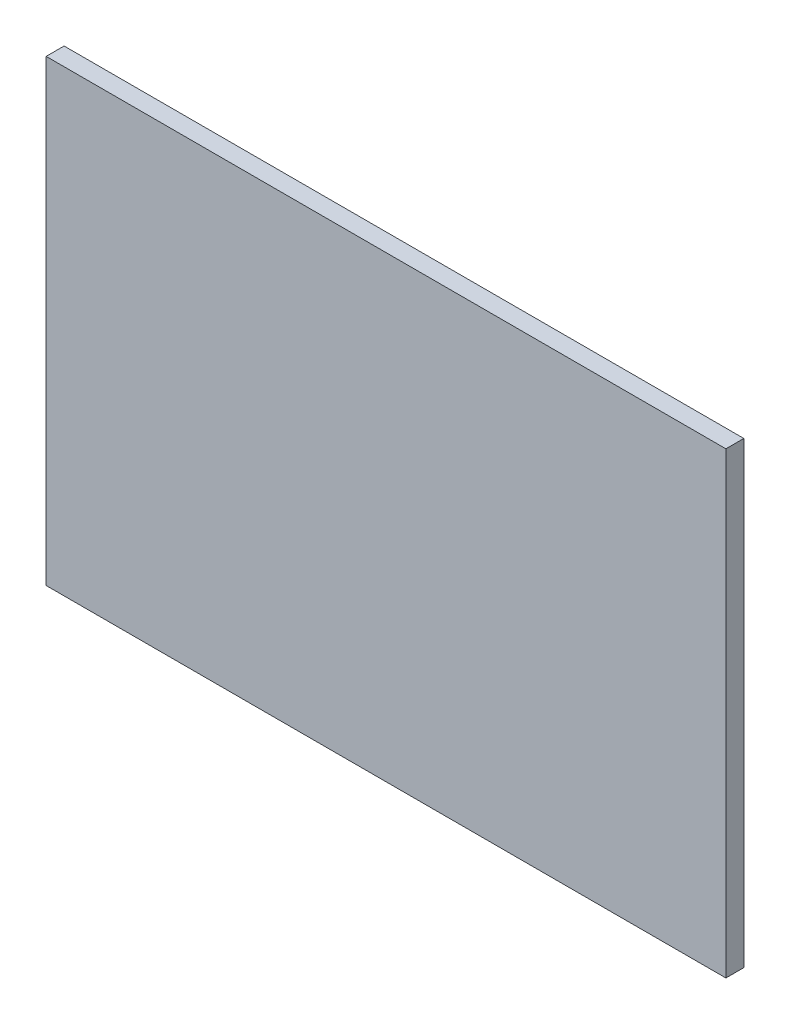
from build123d import *

# Parameters (mm, degrees)
CROQUIS1_W              = 947
CROQUIS1_H              = 638.5
SALIENTE_EXTRUIR1_DEPTH = 25


with BuildPart() as part:
    # Croquis1 → Saliente-Extruir1 (new body)
    with BuildSketch(Plane.XY):
        with Locations((473.5, 319.25)):
            Rectangle(CROQUIS1_W, CROQUIS1_H)
    extrude(amount=SALIENTE_EXTRUIR1_DEPTH)


solid = part.part
